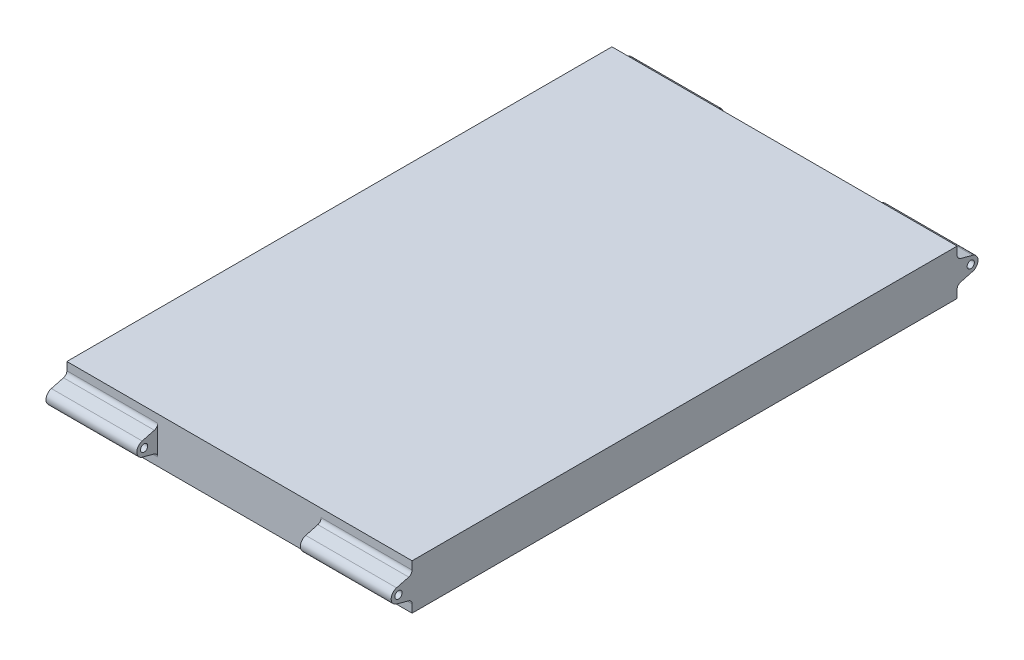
ISO-10303-21;
HEADER;
FILE_DESCRIPTION(('STEP AP214'),'2;1');
FILE_NAME('part.step','',(''),(''),'','','');
FILE_SCHEMA(('AUTOMOTIVE_DESIGN { 1 0 10303 214 1 1 1 1 }'));
ENDSEC;
DATA;
#1=APPLICATION_CONTEXT('core data for automotive mechanical design processes');
#2=APPLICATION_PROTOCOL_DEFINITION('international standard','automotive_design',2000,#1);
#3=PRODUCT_CONTEXT('',#1,'mechanical');
#4=PRODUCT('Part','Part','',(#3));
#5=PRODUCT_RELATED_PRODUCT_CATEGORY('part','',(#4));
#6=PRODUCT_DEFINITION_FORMATION('','',#4);
#7=PRODUCT_DEFINITION_CONTEXT('part definition',#1,'design');
#8=PRODUCT_DEFINITION('design','',#6,#7);
#9=PRODUCT_DEFINITION_SHAPE('','',#8);
#10=(LENGTH_UNIT() NAMED_UNIT(*) SI_UNIT(.MILLI.,.METRE.));
#11=(NAMED_UNIT(*) PLANE_ANGLE_UNIT() SI_UNIT($,.RADIAN.));
#12=(NAMED_UNIT(*) SI_UNIT($,.STERADIAN.) SOLID_ANGLE_UNIT());
#13=UNCERTAINTY_MEASURE_WITH_UNIT(LENGTH_MEASURE(1.E-05),#10,'distance_accuracy_value','');
#14=(GEOMETRIC_REPRESENTATION_CONTEXT(3) GLOBAL_UNCERTAINTY_ASSIGNED_CONTEXT((#13)) GLOBAL_UNIT_ASSIGNED_CONTEXT((#10,
#11,#12)) REPRESENTATION_CONTEXT('',''));
#15=CARTESIAN_POINT('',(0.,0.,0.));
#16=DIRECTION('',(0.,0.,1.));
#17=DIRECTION('',(1.,0.,0.));
#18=AXIS2_PLACEMENT_3D('',#15,#16,#17);
#19=CARTESIAN_POINT('',(-190.,10.,300.));
#20=DIRECTION('',(0.,0.,-1.));
#21=DIRECTION('',(-1.,0.,0.));
#22=AXIS2_PLACEMENT_3D('',#19,#20,#21);
#23=PLANE('',#22);
#24=DIRECTION('',(0.,-1.,0.));
#25=VECTOR('',#24,1.);
#26=CARTESIAN_POINT('',(-190.,10.,300.));
#27=LINE('',#26,#25);
#28=CARTESIAN_POINT('',(-190.,10.,300.));
#29=VERTEX_POINT('',#28);
#30=CARTESIAN_POINT('',(-190.,1.13808226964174,300.));
#31=VERTEX_POINT('',#30);
#32=EDGE_CURVE('E450',#29,#31,#27,.T.);
#33=ORIENTED_EDGE('',*,*,#32,.T.);
#34=DIRECTION('',(-1.,0.,0.));
#35=VECTOR('',#34,1.);
#36=CARTESIAN_POINT('',(-89.9999999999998,1.13808226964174,300.));
#37=LINE('',#36,#35);
#38=CARTESIAN_POINT('',(-89.9999999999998,1.13808226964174,300.));
#39=VERTEX_POINT('',#38);
#40=EDGE_CURVE('E469',#31,#39,#37,.F.);
#41=ORIENTED_EDGE('',*,*,#40,.T.);
#42=DIRECTION('',(0.,1.,0.));
#43=VECTOR('',#42,1.);
#44=CARTESIAN_POINT('',(-89.9999999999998,-27.301447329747,300.));
#45=LINE('',#44,#43);
#46=CARTESIAN_POINT('',(-89.9999999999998,-31.1380822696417,300.));
#47=VERTEX_POINT('',#46);
#48=EDGE_CURVE('E322',#47,#39,#45,.T.);
#49=ORIENTED_EDGE('',*,*,#48,.F.);
#50=DIRECTION('',(-1.,0.,0.));
#51=VECTOR('',#50,1.);
#52=CARTESIAN_POINT('',(-190.,-31.1380822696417,300.));
#53=LINE('',#52,#51);
#54=CARTESIAN_POINT('',(-190.,-31.1380822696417,300.));
#55=VERTEX_POINT('',#54);
#56=EDGE_CURVE('E572',#47,#55,#53,.T.);
#57=ORIENTED_EDGE('',*,*,#56,.T.);
#58=CARTESIAN_POINT('',(-190.,-40.,300.));
#59=VERTEX_POINT('',#58);
#60=EDGE_CURVE('E461',#55,#59,#27,.T.);
#61=ORIENTED_EDGE('',*,*,#60,.T.);
#62=DIRECTION('',(1.,0.,0.));
#63=VECTOR('',#62,1.);
#64=CARTESIAN_POINT('',(-190.,-40.,300.));
#65=LINE('',#64,#63);
#66=CARTESIAN_POINT('',(190.,-40.,300.));
#67=VERTEX_POINT('',#66);
#68=EDGE_CURVE('E435',#59,#67,#65,.T.);
#69=ORIENTED_EDGE('',*,*,#68,.T.);
#70=DIRECTION('',(0.,-1.,0.));
#71=VECTOR('',#70,1.);
#72=CARTESIAN_POINT('',(190.,10.,300.));
#73=LINE('',#72,#71);
#74=CARTESIAN_POINT('',(190.,-31.1380822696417,300.));
#75=VERTEX_POINT('',#74);
#76=EDGE_CURVE('E447',#75,#67,#73,.T.);
#77=ORIENTED_EDGE('',*,*,#76,.F.);
#78=DIRECTION('',(1.,0.,0.));
#79=VECTOR('',#78,1.);
#80=CARTESIAN_POINT('',(-190.,-31.1380822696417,300.));
#81=LINE('',#80,#79);
#82=CARTESIAN_POINT('',(89.9999999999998,-31.1380822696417,300.));
#83=VERTEX_POINT('',#82);
#84=EDGE_CURVE('E524',#75,#83,#81,.F.);
#85=ORIENTED_EDGE('',*,*,#84,.T.);
#86=DIRECTION('',(0.,1.,0.));
#87=VECTOR('',#86,1.);
#88=CARTESIAN_POINT('',(89.9999999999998,-27.301447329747,300.));
#89=LINE('',#88,#87);
#90=CARTESIAN_POINT('',(89.9999999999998,1.13808226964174,300.));
#91=VERTEX_POINT('',#90);
#92=EDGE_CURVE('E378',#83,#91,#89,.T.);
#93=ORIENTED_EDGE('',*,*,#92,.T.);
#94=DIRECTION('',(1.,0.,0.));
#95=VECTOR('',#94,1.);
#96=CARTESIAN_POINT('',(-190.,1.13808226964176,300.));
#97=LINE('',#96,#95);
#98=CARTESIAN_POINT('',(190.,1.13808226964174,300.));
#99=VERTEX_POINT('',#98);
#100=EDGE_CURVE('E578',#91,#99,#97,.T.);
#101=ORIENTED_EDGE('',*,*,#100,.T.);
#102=CARTESIAN_POINT('',(190.,10.,300.));
#103=VERTEX_POINT('',#102);
#104=EDGE_CURVE('E457',#103,#99,#73,.T.);
#105=ORIENTED_EDGE('',*,*,#104,.F.);
#106=DIRECTION('',(1.,0.,0.));
#107=VECTOR('',#106,1.);
#108=CARTESIAN_POINT('',(-190.,10.,300.));
#109=LINE('',#108,#107);
#110=EDGE_CURVE('E445',#29,#103,#109,.T.);
#111=ORIENTED_EDGE('',*,*,#110,.F.);
#112=EDGE_LOOP('',(#33,#41,#49,#57,#61,#69,#77,#85,#93,#101,#105,#111));
#113=FACE_BOUND('',#112,.T.);
#114=ADVANCED_FACE('F60',(#113),#23,.F.);
#115=CARTESIAN_POINT('',(-190.,10.,-300.));
#116=DIRECTION('',(0.,0.,1.));
#117=DIRECTION('',(1.,0.,0.));
#118=AXIS2_PLACEMENT_3D('',#115,#116,#117);
#119=PLANE('',#118);
#120=DIRECTION('',(0.,1.,0.));
#121=VECTOR('',#120,1.);
#122=CARTESIAN_POINT('',(-89.9999999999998,-27.301447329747,-300.));
#123=LINE('',#122,#121);
#124=CARTESIAN_POINT('',(-89.9999999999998,-31.1380822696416,-300.));
#125=VERTEX_POINT('',#124);
#126=CARTESIAN_POINT('',(-89.9999999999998,1.13808226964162,-300.));
#127=VERTEX_POINT('',#126);
#128=EDGE_CURVE('E290',#125,#127,#123,.T.);
#129=ORIENTED_EDGE('',*,*,#128,.T.);
#130=DIRECTION('',(-1.,0.,0.));
#131=VECTOR('',#130,1.);
#132=CARTESIAN_POINT('',(-190.,1.13808226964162,-300.));
#133=LINE('',#132,#131);
#134=CARTESIAN_POINT('',(-190.,1.13808226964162,-300.));
#135=VERTEX_POINT('',#134);
#136=EDGE_CURVE('E562',#127,#135,#133,.T.);
#137=ORIENTED_EDGE('',*,*,#136,.T.);
#138=DIRECTION('',(0.,-1.,0.));
#139=VECTOR('',#138,1.);
#140=CARTESIAN_POINT('',(-190.,10.,-300.));
#141=LINE('',#140,#139);
#142=CARTESIAN_POINT('',(-190.,10.,-300.));
#143=VERTEX_POINT('',#142);
#144=EDGE_CURVE('E544',#143,#135,#141,.T.);
#145=ORIENTED_EDGE('',*,*,#144,.F.);
#146=DIRECTION('',(-1.,0.,0.));
#147=VECTOR('',#146,1.);
#148=CARTESIAN_POINT('',(-190.,10.,-300.));
#149=LINE('',#148,#147);
#150=CARTESIAN_POINT('',(190.,10.,-300.));
#151=VERTEX_POINT('',#150);
#152=EDGE_CURVE('E441',#151,#143,#149,.T.);
#153=ORIENTED_EDGE('',*,*,#152,.F.);
#154=DIRECTION('',(0.,-1.,0.));
#155=VECTOR('',#154,1.);
#156=CARTESIAN_POINT('',(190.,10.,-300.));
#157=LINE('',#156,#155);
#158=CARTESIAN_POINT('',(190.,1.13808226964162,-300.));
#159=VERTEX_POINT('',#158);
#160=EDGE_CURVE('E543',#151,#159,#157,.T.);
#161=ORIENTED_EDGE('',*,*,#160,.T.);
#162=DIRECTION('',(1.,0.,0.));
#163=VECTOR('',#162,1.);
#164=CARTESIAN_POINT('',(89.9999999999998,1.13808226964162,-300.));
#165=LINE('',#164,#163);
#166=CARTESIAN_POINT('',(89.9999999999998,1.13808226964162,-300.));
#167=VERTEX_POINT('',#166);
#168=EDGE_CURVE('E559',#159,#167,#165,.F.);
#169=ORIENTED_EDGE('',*,*,#168,.T.);
#170=DIRECTION('',(0.,1.,0.));
#171=VECTOR('',#170,1.);
#172=CARTESIAN_POINT('',(89.9999999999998,-27.301447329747,-300.));
#173=LINE('',#172,#171);
#174=CARTESIAN_POINT('',(89.9999999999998,-31.1380822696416,-300.));
#175=VERTEX_POINT('',#174);
#176=EDGE_CURVE('E350',#175,#167,#173,.T.);
#177=ORIENTED_EDGE('',*,*,#176,.F.);
#178=DIRECTION('',(1.,0.,0.));
#179=VECTOR('',#178,1.);
#180=CARTESIAN_POINT('',(190.,-31.1380822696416,-300.));
#181=LINE('',#180,#179);
#182=CARTESIAN_POINT('',(190.,-31.1380822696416,-300.));
#183=VERTEX_POINT('',#182);
#184=EDGE_CURVE('E557',#175,#183,#181,.T.);
#185=ORIENTED_EDGE('',*,*,#184,.T.);
#186=CARTESIAN_POINT('',(190.,-40.,-300.));
#187=VERTEX_POINT('',#186);
#188=EDGE_CURVE('E539',#183,#187,#157,.T.);
#189=ORIENTED_EDGE('',*,*,#188,.T.);
#190=DIRECTION('',(-1.,0.,0.));
#191=VECTOR('',#190,1.);
#192=CARTESIAN_POINT('',(-190.,-40.,-300.));
#193=LINE('',#192,#191);
#194=CARTESIAN_POINT('',(-190.,-40.,-300.));
#195=VERTEX_POINT('',#194);
#196=EDGE_CURVE('E429',#187,#195,#193,.T.);
#197=ORIENTED_EDGE('',*,*,#196,.T.);
#198=CARTESIAN_POINT('',(-190.,-31.1380822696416,-300.));
#199=VERTEX_POINT('',#198);
#200=EDGE_CURVE('E550',#199,#195,#141,.T.);
#201=ORIENTED_EDGE('',*,*,#200,.F.);
#202=DIRECTION('',(-1.,0.,0.));
#203=VECTOR('',#202,1.);
#204=CARTESIAN_POINT('',(-190.,-31.1380822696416,-300.));
#205=LINE('',#204,#203);
#206=EDGE_CURVE('E547',#199,#125,#205,.F.);
#207=ORIENTED_EDGE('',*,*,#206,.T.);
#208=EDGE_LOOP('',(#129,#137,#145,#153,#161,#169,#177,#185,#189,#197,#201,#207));
#209=FACE_BOUND('',#208,.T.);
#210=ADVANCED_FACE('F608',(#209),#119,.F.);
#211=CARTESIAN_POINT('',(190.,10.,-300.));
#212=DIRECTION('',(-1.,0.,0.));
#213=DIRECTION('',(0.,0.,1.));
#214=AXIS2_PLACEMENT_3D('',#211,#212,#213);
#215=PLANE('',#214);
#216=ORIENTED_EDGE('',*,*,#104,.T.);
#217=CARTESIAN_POINT('',(190.,1.13808226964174,305.));
#218=DIRECTION('',(-1.,0.,0.));
#219=DIRECTION('',(0.,0.,1.));
#220=AXIS2_PLACEMENT_3D('',#217,#218,#219);
#221=CIRCLE('',#220,5.);
#222=CARTESIAN_POINT('',(190.,-3.6915468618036,303.705904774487));
#223=VERTEX_POINT('',#222);
#224=EDGE_CURVE('E494',#99,#223,#221,.T.);
#225=ORIENTED_EDGE('',*,*,#224,.T.);
#226=DIRECTION('',(0.,-0.258819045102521,0.965925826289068));
#227=VECTOR('',#226,1.);
#228=CARTESIAN_POINT('',(190.,-7.27259338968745,317.070552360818));
#229=LINE('',#228,#227);
#230=CARTESIAN_POINT('',(190.,-7.27259338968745,317.070552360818));
#231=VERTEX_POINT('',#230);
#232=EDGE_CURVE('E375',#223,#231,#229,.T.);
#233=ORIENTED_EDGE('',*,*,#232,.T.);
#234=CARTESIAN_POINT('',(190.,-15.,314.999999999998));
#235=DIRECTION('',(1.,0.,0.));
#236=DIRECTION('',(0.,0.,-1.));
#237=AXIS2_PLACEMENT_3D('',#234,#235,#236);
#238=CIRCLE('',#237,8.);
#239=CARTESIAN_POINT('',(190.,-22.7274066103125,317.070552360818));
#240=VERTEX_POINT('',#239);
#241=EDGE_CURVE('E368',#231,#240,#238,.T.);
#242=ORIENTED_EDGE('',*,*,#241,.T.);
#243=DIRECTION('',(0.,-0.258819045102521,-0.965925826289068));
#244=VECTOR('',#243,1.);
#245=CARTESIAN_POINT('',(190.,-22.7274066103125,317.070552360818));
#246=LINE('',#245,#244);
#247=CARTESIAN_POINT('',(190.,-26.3084531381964,303.705904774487));
#248=VERTEX_POINT('',#247);
#249=EDGE_CURVE('E385',#240,#248,#246,.T.);
#250=ORIENTED_EDGE('',*,*,#249,.T.);
#251=CARTESIAN_POINT('',(190.,-31.1380822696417,305.));
#252=DIRECTION('',(-1.,0.,0.));
#253=DIRECTION('',(0.,0.,1.));
#254=AXIS2_PLACEMENT_3D('',#251,#252,#253);
#255=CIRCLE('',#254,5.);
#256=EDGE_CURVE('E507',#248,#75,#255,.T.);
#257=ORIENTED_EDGE('',*,*,#256,.T.);
#258=ORIENTED_EDGE('',*,*,#76,.T.);
#259=DIRECTION('',(0.,0.,-1.));
#260=VECTOR('',#259,1.);
#261=CARTESIAN_POINT('',(190.,-40.,-300.));
#262=LINE('',#261,#260);
#263=EDGE_CURVE('E418',#67,#187,#262,.T.);
#264=ORIENTED_EDGE('',*,*,#263,.T.);
#265=ORIENTED_EDGE('',*,*,#188,.F.);
#266=CARTESIAN_POINT('',(190.,-31.1380822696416,-305.));
#267=DIRECTION('',(-1.,0.,0.));
#268=DIRECTION('',(0.,0.,1.));
#269=AXIS2_PLACEMENT_3D('',#266,#267,#268);
#270=CIRCLE('',#269,5.);
#271=CARTESIAN_POINT('',(190.,-26.3084531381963,-303.705904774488));
#272=VERTEX_POINT('',#271);
#273=EDGE_CURVE('E499',#183,#272,#270,.T.);
#274=ORIENTED_EDGE('',*,*,#273,.T.);
#275=DIRECTION('',(0.,-0.258819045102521,0.965925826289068));
#276=VECTOR('',#275,1.);
#277=CARTESIAN_POINT('',(190.,-22.7274066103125,-317.070552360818));
#278=LINE('',#277,#276);
#279=CARTESIAN_POINT('',(190.,-22.7274066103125,-317.070552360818));
#280=VERTEX_POINT('',#279);
#281=EDGE_CURVE('E348',#280,#272,#278,.T.);
#282=ORIENTED_EDGE('',*,*,#281,.F.);
#283=CARTESIAN_POINT('',(190.,-15.,-314.999999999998));
#284=DIRECTION('',(-1.,0.,0.));
#285=DIRECTION('',(0.,0.,1.));
#286=AXIS2_PLACEMENT_3D('',#283,#284,#285);
#287=CIRCLE('',#286,8.);
#288=CARTESIAN_POINT('',(190.,-7.27259338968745,-317.070552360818));
#289=VERTEX_POINT('',#288);
#290=EDGE_CURVE('E341',#289,#280,#287,.T.);
#291=ORIENTED_EDGE('',*,*,#290,.F.);
#292=DIRECTION('',(0.,-0.258819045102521,-0.965925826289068));
#293=VECTOR('',#292,1.);
#294=CARTESIAN_POINT('',(190.,-7.27259338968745,-317.070552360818));
#295=LINE('',#294,#293);
#296=CARTESIAN_POINT('',(190.,-3.69154686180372,-303.705904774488));
#297=VERTEX_POINT('',#296);
#298=EDGE_CURVE('E358',#297,#289,#295,.T.);
#299=ORIENTED_EDGE('',*,*,#298,.F.);
#300=CARTESIAN_POINT('',(190.,1.13808226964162,-305.));
#301=DIRECTION('',(-1.,0.,0.));
#302=DIRECTION('',(0.,0.,1.));
#303=AXIS2_PLACEMENT_3D('',#300,#301,#302);
#304=CIRCLE('',#303,5.);
#305=EDGE_CURVE('E486',#297,#159,#304,.T.);
#306=ORIENTED_EDGE('',*,*,#305,.T.);
#307=ORIENTED_EDGE('',*,*,#160,.F.);
#308=DIRECTION('',(0.,0.,-1.));
#309=VECTOR('',#308,1.);
#310=CARTESIAN_POINT('',(190.,10.,-300.));
#311=LINE('',#310,#309);
#312=EDGE_CURVE('E438',#103,#151,#311,.T.);
#313=ORIENTED_EDGE('',*,*,#312,.F.);
#314=EDGE_LOOP('',(#216,#225,#233,#242,#250,#257,#258,#264,#265,#274,#282,#291,#299,#306,#307,#313));
#315=FACE_BOUND('',#314,.T.);
#316=CARTESIAN_POINT('',(190.,-15.,314.999999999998));
#317=DIRECTION('',(1.,0.,0.));
#318=DIRECTION('',(0.,0.,1.));
#319=AXIS2_PLACEMENT_3D('',#316,#317,#318);
#320=CIRCLE('',#319,3.99999999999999);
#321=CARTESIAN_POINT('',(190.,-15.,318.999999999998));
#322=VERTEX_POINT('',#321);
#323=EDGE_CURVE('E362',#322,#322,#320,.T.);
#324=ORIENTED_EDGE('',*,*,#323,.F.);
#325=EDGE_LOOP('',(#324));
#326=FACE_BOUND('',#325,.T.);
#327=CARTESIAN_POINT('',(190.,-15.,-314.999999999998));
#328=DIRECTION('',(-1.,0.,0.));
#329=DIRECTION('',(0.,0.,-1.));
#330=AXIS2_PLACEMENT_3D('',#327,#328,#329);
#331=CIRCLE('',#330,3.99999999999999);
#332=CARTESIAN_POINT('',(190.,-15.,-318.999999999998));
#333=VERTEX_POINT('',#332);
#334=EDGE_CURVE('E335',#333,#333,#331,.T.);
#335=ORIENTED_EDGE('',*,*,#334,.T.);
#336=EDGE_LOOP('',(#335));
#337=FACE_BOUND('',#336,.T.);
#338=ADVANCED_FACE('F527',(#315,#326,#337),#215,.F.);
#339=CARTESIAN_POINT('',(-190.,10.,-300.));
#340=DIRECTION('',(1.,0.,0.));
#341=DIRECTION('',(0.,0.,-1.));
#342=AXIS2_PLACEMENT_3D('',#339,#340,#341);
#343=PLANE('',#342);
#344=ORIENTED_EDGE('',*,*,#144,.T.);
#345=CARTESIAN_POINT('',(-190.,1.13808226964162,-305.));
#346=DIRECTION('',(1.,0.,0.));
#347=DIRECTION('',(0.,0.,-1.));
#348=AXIS2_PLACEMENT_3D('',#345,#346,#347);
#349=CIRCLE('',#348,5.);
#350=CARTESIAN_POINT('',(-190.,-3.69154686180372,-303.705904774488));
#351=VERTEX_POINT('',#350);
#352=EDGE_CURVE('E481',#135,#351,#349,.T.);
#353=ORIENTED_EDGE('',*,*,#352,.T.);
#354=DIRECTION('',(0.,-0.258819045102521,-0.965925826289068));
#355=VECTOR('',#354,1.);
#356=CARTESIAN_POINT('',(-190.,-7.27259338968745,-317.070552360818));
#357=LINE('',#356,#355);
#358=CARTESIAN_POINT('',(-190.,-7.27259338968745,-317.070552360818));
#359=VERTEX_POINT('',#358);
#360=EDGE_CURVE('E295',#351,#359,#357,.T.);
#361=ORIENTED_EDGE('',*,*,#360,.T.);
#362=CARTESIAN_POINT('',(-190.,-15.,-314.999999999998));
#363=DIRECTION('',(-1.,0.,0.));
#364=DIRECTION('',(0.,0.,1.));
#365=AXIS2_PLACEMENT_3D('',#362,#363,#364);
#366=CIRCLE('',#365,8.);
#367=CARTESIAN_POINT('',(-190.,-22.7274066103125,-317.070552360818));
#368=VERTEX_POINT('',#367);
#369=EDGE_CURVE('E304',#359,#368,#366,.T.);
#370=ORIENTED_EDGE('',*,*,#369,.T.);
#371=DIRECTION('',(0.,-0.258819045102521,0.965925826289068));
#372=VECTOR('',#371,1.);
#373=CARTESIAN_POINT('',(-190.,-22.7274066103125,-317.070552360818));
#374=LINE('',#373,#372);
#375=CARTESIAN_POINT('',(-190.,-26.3084531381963,-303.705904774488));
#376=VERTEX_POINT('',#375);
#377=EDGE_CURVE('E275',#368,#376,#374,.T.);
#378=ORIENTED_EDGE('',*,*,#377,.T.);
#379=CARTESIAN_POINT('',(-190.,-31.1380822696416,-305.));
#380=DIRECTION('',(1.,0.,0.));
#381=DIRECTION('',(0.,0.,-1.));
#382=AXIS2_PLACEMENT_3D('',#379,#380,#381);
#383=CIRCLE('',#382,5.);
#384=EDGE_CURVE('E504',#376,#199,#383,.T.);
#385=ORIENTED_EDGE('',*,*,#384,.T.);
#386=ORIENTED_EDGE('',*,*,#200,.T.);
#387=DIRECTION('',(0.,0.,1.));
#388=VECTOR('',#387,1.);
#389=CARTESIAN_POINT('',(-190.,-40.,-300.));
#390=LINE('',#389,#388);
#391=EDGE_CURVE('E432',#195,#59,#390,.T.);
#392=ORIENTED_EDGE('',*,*,#391,.T.);
#393=ORIENTED_EDGE('',*,*,#60,.F.);
#394=CARTESIAN_POINT('',(-190.,-31.1380822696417,305.));
#395=DIRECTION('',(1.,0.,0.));
#396=DIRECTION('',(0.,0.,-1.));
#397=AXIS2_PLACEMENT_3D('',#394,#395,#396);
#398=CIRCLE('',#397,5.);
#399=CARTESIAN_POINT('',(-190.,-26.3084531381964,303.705904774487));
#400=VERTEX_POINT('',#399);
#401=EDGE_CURVE('E68',#55,#400,#398,.T.);
#402=ORIENTED_EDGE('',*,*,#401,.T.);
#403=DIRECTION('',(0.,-0.258819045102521,-0.965925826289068));
#404=VECTOR('',#403,1.);
#405=CARTESIAN_POINT('',(-190.,-22.7274066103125,317.070552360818));
#406=LINE('',#405,#404);
#407=CARTESIAN_POINT('',(-190.,-22.7274066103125,317.070552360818));
#408=VERTEX_POINT('',#407);
#409=EDGE_CURVE('E320',#408,#400,#406,.T.);
#410=ORIENTED_EDGE('',*,*,#409,.F.);
#411=CARTESIAN_POINT('',(-190.,-15.,314.999999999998));
#412=DIRECTION('',(1.,0.,0.));
#413=DIRECTION('',(0.,0.,-1.));
#414=AXIS2_PLACEMENT_3D('',#411,#412,#413);
#415=CIRCLE('',#414,8.);
#416=CARTESIAN_POINT('',(-190.,-7.27259338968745,317.070552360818));
#417=VERTEX_POINT('',#416);
#418=EDGE_CURVE('E313',#417,#408,#415,.T.);
#419=ORIENTED_EDGE('',*,*,#418,.F.);
#420=DIRECTION('',(0.,-0.258819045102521,0.965925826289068));
#421=VECTOR('',#420,1.);
#422=CARTESIAN_POINT('',(-190.,-7.27259338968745,317.070552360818));
#423=LINE('',#422,#421);
#424=CARTESIAN_POINT('',(-190.,-3.6915468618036,303.705904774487));
#425=VERTEX_POINT('',#424);
#426=EDGE_CURVE('E329',#425,#417,#423,.T.);
#427=ORIENTED_EDGE('',*,*,#426,.F.);
#428=CARTESIAN_POINT('',(-190.,1.13808226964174,305.));
#429=DIRECTION('',(1.,0.,0.));
#430=DIRECTION('',(0.,0.,-1.));
#431=AXIS2_PLACEMENT_3D('',#428,#429,#430);
#432=CIRCLE('',#431,5.);
#433=EDGE_CURVE('E490',#425,#31,#432,.T.);
#434=ORIENTED_EDGE('',*,*,#433,.T.);
#435=ORIENTED_EDGE('',*,*,#32,.F.);
#436=DIRECTION('',(0.,0.,1.));
#437=VECTOR('',#436,1.);
#438=CARTESIAN_POINT('',(-190.,10.,-300.));
#439=LINE('',#438,#437);
#440=EDGE_CURVE('E443',#143,#29,#439,.T.);
#441=ORIENTED_EDGE('',*,*,#440,.F.);
#442=EDGE_LOOP('',(#344,#353,#361,#370,#378,#385,#386,#392,#393,#402,#410,#419,#427,#434,#435,#441));
#443=FACE_BOUND('',#442,.T.);
#444=CARTESIAN_POINT('',(-190.,-15.,314.999999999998));
#445=DIRECTION('',(1.,0.,0.));
#446=DIRECTION('',(0.,0.,1.));
#447=AXIS2_PLACEMENT_3D('',#444,#445,#446);
#448=CIRCLE('',#447,3.99999999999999);
#449=CARTESIAN_POINT('',(-190.,-15.,318.999999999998));
#450=VERTEX_POINT('',#449);
#451=EDGE_CURVE('E308',#450,#450,#448,.T.);
#452=ORIENTED_EDGE('',*,*,#451,.T.);
#453=EDGE_LOOP('',(#452));
#454=FACE_BOUND('',#453,.T.);
#455=CARTESIAN_POINT('',(-190.,-15.,-314.999999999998));
#456=DIRECTION('',(-1.,0.,0.));
#457=DIRECTION('',(0.,0.,-1.));
#458=AXIS2_PLACEMENT_3D('',#455,#456,#457);
#459=CIRCLE('',#458,3.99999999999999);
#460=CARTESIAN_POINT('',(-190.,-15.,-318.999999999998));
#461=VERTEX_POINT('',#460);
#462=EDGE_CURVE('E299',#461,#461,#459,.T.);
#463=ORIENTED_EDGE('',*,*,#462,.F.);
#464=EDGE_LOOP('',(#463));
#465=FACE_BOUND('',#464,.T.);
#466=ADVANCED_FACE('F618',(#443,#454,#465),#343,.F.);
#467=CARTESIAN_POINT('',(190.,10.,300.));
#468=DIRECTION('',(0.,1.,0.));
#469=DIRECTION('',(0.,0.,1.));
#470=AXIS2_PLACEMENT_3D('',#467,#468,#469);
#471=PLANE('',#470);
#472=ORIENTED_EDGE('',*,*,#312,.T.);
#473=ORIENTED_EDGE('',*,*,#152,.T.);
#474=ORIENTED_EDGE('',*,*,#440,.T.);
#475=ORIENTED_EDGE('',*,*,#110,.T.);
#476=EDGE_LOOP('',(#472,#473,#474,#475));
#477=FACE_BOUND('',#476,.T.);
#478=ADVANCED_FACE('F620',(#477),#471,.T.);
#479=CARTESIAN_POINT('',(190.,-40.,-300.));
#480=DIRECTION('',(0.,1.,0.));
#481=DIRECTION('',(0.,0.,1.));
#482=AXIS2_PLACEMENT_3D('',#479,#480,#481);
#483=PLANE('',#482);
#484=DIRECTION('',(1.,0.,0.));
#485=VECTOR('',#484,1.);
#486=CARTESIAN_POINT('',(-190.,-40.,290.));
#487=LINE('',#486,#485);
#488=CARTESIAN_POINT('',(-180.,-40.,290.));
#489=VERTEX_POINT('',#488);
#490=CARTESIAN_POINT('',(180.,-40.,290.));
#491=VERTEX_POINT('',#490);
#492=EDGE_CURVE('E401',#489,#491,#487,.T.);
#493=ORIENTED_EDGE('',*,*,#492,.T.);
#494=DIRECTION('',(0.,0.,-1.));
#495=VECTOR('',#494,1.);
#496=CARTESIAN_POINT('',(180.,-40.,-300.));
#497=LINE('',#496,#495);
#498=CARTESIAN_POINT('',(180.,-40.,-290.));
#499=VERTEX_POINT('',#498);
#500=EDGE_CURVE('E391',#491,#499,#497,.T.);
#501=ORIENTED_EDGE('',*,*,#500,.T.);
#502=DIRECTION('',(-1.,0.,0.));
#503=VECTOR('',#502,1.);
#504=CARTESIAN_POINT('',(-190.,-40.,-290.));
#505=LINE('',#504,#503);
#506=CARTESIAN_POINT('',(-180.,-40.,-290.));
#507=VERTEX_POINT('',#506);
#508=EDGE_CURVE('E394',#499,#507,#505,.T.);
#509=ORIENTED_EDGE('',*,*,#508,.T.);
#510=DIRECTION('',(0.,0.,1.));
#511=VECTOR('',#510,1.);
#512=CARTESIAN_POINT('',(-180.,-40.,-300.));
#513=LINE('',#512,#511);
#514=EDGE_CURVE('E398',#507,#489,#513,.T.);
#515=ORIENTED_EDGE('',*,*,#514,.T.);
#516=EDGE_LOOP('',(#493,#501,#509,#515));
#517=FACE_BOUND('',#516,.T.);
#518=ORIENTED_EDGE('',*,*,#263,.F.);
#519=ORIENTED_EDGE('',*,*,#68,.F.);
#520=ORIENTED_EDGE('',*,*,#391,.F.);
#521=ORIENTED_EDGE('',*,*,#196,.F.);
#522=EDGE_LOOP('',(#518,#519,#520,#521));
#523=FACE_BOUND('',#522,.T.);
#524=ADVANCED_FACE('F536',(#517,#523),#483,.F.);
#525=CARTESIAN_POINT('',(180.,-40.,-300.));
#526=DIRECTION('',(1.,0.,0.));
#527=DIRECTION('',(0.,0.,-1.));
#528=AXIS2_PLACEMENT_3D('',#525,#526,#527);
#529=PLANE('',#528);
#530=DIRECTION('',(0.,0.,-1.));
#531=VECTOR('',#530,1.);
#532=CARTESIAN_POINT('',(180.,0.,-300.));
#533=LINE('',#532,#531);
#534=CARTESIAN_POINT('',(180.,0.,290.));
#535=VERTEX_POINT('',#534);
#536=CARTESIAN_POINT('',(180.,0.,-290.));
#537=VERTEX_POINT('',#536);
#538=EDGE_CURVE('E389',#535,#537,#533,.T.);
#539=ORIENTED_EDGE('',*,*,#538,.T.);
#540=DIRECTION('',(0.,1.,0.));
#541=VECTOR('',#540,1.);
#542=CARTESIAN_POINT('',(180.,-40.,-290.));
#543=LINE('',#542,#541);
#544=EDGE_CURVE('E404',#499,#537,#543,.T.);
#545=ORIENTED_EDGE('',*,*,#544,.F.);
#546=ORIENTED_EDGE('',*,*,#500,.F.);
#547=DIRECTION('',(0.,1.,0.));
#548=VECTOR('',#547,1.);
#549=CARTESIAN_POINT('',(180.,-40.,290.));
#550=LINE('',#549,#548);
#551=EDGE_CURVE('E415',#491,#535,#550,.T.);
#552=ORIENTED_EDGE('',*,*,#551,.T.);
#553=EDGE_LOOP('',(#539,#545,#546,#552));
#554=FACE_BOUND('',#553,.T.);
#555=ADVANCED_FACE('F718',(#554),#529,.F.);
#556=CARTESIAN_POINT('',(-190.,-40.,290.));
#557=DIRECTION('',(0.,0.,1.));
#558=DIRECTION('',(1.,0.,0.));
#559=AXIS2_PLACEMENT_3D('',#556,#557,#558);
#560=PLANE('',#559);
#561=DIRECTION('',(1.,0.,0.));
#562=VECTOR('',#561,1.);
#563=CARTESIAN_POINT('',(-190.,0.,290.));
#564=LINE('',#563,#562);
#565=CARTESIAN_POINT('',(-180.,0.,290.));
#566=VERTEX_POINT('',#565);
#567=EDGE_CURVE('E395',#566,#535,#564,.T.);
#568=ORIENTED_EDGE('',*,*,#567,.T.);
#569=ORIENTED_EDGE('',*,*,#551,.F.);
#570=ORIENTED_EDGE('',*,*,#492,.F.);
#571=DIRECTION('',(0.,1.,0.));
#572=VECTOR('',#571,1.);
#573=CARTESIAN_POINT('',(-180.,-40.,290.));
#574=LINE('',#573,#572);
#575=EDGE_CURVE('E419',#489,#566,#574,.T.);
#576=ORIENTED_EDGE('',*,*,#575,.T.);
#577=EDGE_LOOP('',(#568,#569,#570,#576));
#578=FACE_BOUND('',#577,.T.);
#579=ADVANCED_FACE('F714',(#578),#560,.F.);
#580=CARTESIAN_POINT('',(-180.,-40.,-300.));
#581=DIRECTION('',(-1.,0.,0.));
#582=DIRECTION('',(0.,0.,1.));
#583=AXIS2_PLACEMENT_3D('',#580,#581,#582);
#584=PLANE('',#583);
#585=DIRECTION('',(0.,0.,1.));
#586=VECTOR('',#585,1.);
#587=CARTESIAN_POINT('',(-180.,0.,-300.));
#588=LINE('',#587,#586);
#589=CARTESIAN_POINT('',(-180.,0.,-290.));
#590=VERTEX_POINT('',#589);
#591=EDGE_CURVE('E410',#590,#566,#588,.T.);
#592=ORIENTED_EDGE('',*,*,#591,.T.);
#593=ORIENTED_EDGE('',*,*,#575,.F.);
#594=ORIENTED_EDGE('',*,*,#514,.F.);
#595=DIRECTION('',(0.,1.,0.));
#596=VECTOR('',#595,1.);
#597=CARTESIAN_POINT('',(-180.,-40.,-290.));
#598=LINE('',#597,#596);
#599=EDGE_CURVE('E422',#507,#590,#598,.T.);
#600=ORIENTED_EDGE('',*,*,#599,.T.);
#601=EDGE_LOOP('',(#592,#593,#594,#600));
#602=FACE_BOUND('',#601,.T.);
#603=ADVANCED_FACE('F717',(#602),#584,.F.);
#604=CARTESIAN_POINT('',(-190.,-40.,-290.));
#605=DIRECTION('',(0.,0.,-1.));
#606=DIRECTION('',(-1.,0.,0.));
#607=AXIS2_PLACEMENT_3D('',#604,#605,#606);
#608=PLANE('',#607);
#609=DIRECTION('',(-1.,0.,0.));
#610=VECTOR('',#609,1.);
#611=CARTESIAN_POINT('',(-190.,0.,-290.));
#612=LINE('',#611,#610);
#613=EDGE_CURVE('E407',#537,#590,#612,.T.);
#614=ORIENTED_EDGE('',*,*,#613,.T.);
#615=ORIENTED_EDGE('',*,*,#599,.F.);
#616=ORIENTED_EDGE('',*,*,#508,.F.);
#617=ORIENTED_EDGE('',*,*,#544,.T.);
#618=EDGE_LOOP('',(#614,#615,#616,#617));
#619=FACE_BOUND('',#618,.T.);
#620=ADVANCED_FACE('F722',(#619),#608,.F.);
#621=CARTESIAN_POINT('',(190.,0.,300.));
#622=DIRECTION('',(0.,1.,0.));
#623=DIRECTION('',(0.,0.,1.));
#624=AXIS2_PLACEMENT_3D('',#621,#622,#623);
#625=PLANE('',#624);
#626=ORIENTED_EDGE('',*,*,#538,.F.);
#627=ORIENTED_EDGE('',*,*,#567,.F.);
#628=ORIENTED_EDGE('',*,*,#591,.F.);
#629=ORIENTED_EDGE('',*,*,#613,.F.);
#630=EDGE_LOOP('',(#626,#627,#628,#629));
#631=FACE_BOUND('',#630,.T.);
#632=ADVANCED_FACE('F616',(#631),#625,.F.);
#633=CARTESIAN_POINT('',(89.9999999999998,-15.,314.999999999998));
#634=DIRECTION('',(1.,0.,0.));
#635=DIRECTION('',(0.,0.,-1.));
#636=AXIS2_PLACEMENT_3D('',#633,#634,#635);
#637=CYLINDRICAL_SURFACE('',#636,8.);
#638=ORIENTED_EDGE('',*,*,#241,.F.);
#639=DIRECTION('',(1.,0.,0.));
#640=VECTOR('',#639,1.);
#641=CARTESIAN_POINT('',(89.9999999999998,-7.27259338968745,317.070552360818));
#642=LINE('',#641,#640);
#643=CARTESIAN_POINT('',(89.9999999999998,-7.27259338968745,317.070552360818));
#644=VERTEX_POINT('',#643);
#645=EDGE_CURVE('E386',#644,#231,#642,.T.);
#646=ORIENTED_EDGE('',*,*,#645,.F.);
#647=CARTESIAN_POINT('',(89.9999999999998,-15.,314.999999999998));
#648=DIRECTION('',(1.,0.,0.));
#649=DIRECTION('',(0.,0.,-1.));
#650=AXIS2_PLACEMENT_3D('',#647,#648,#649);
#651=CIRCLE('',#650,8.);
#652=CARTESIAN_POINT('',(89.9999999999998,-22.7274066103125,317.070552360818));
#653=VERTEX_POINT('',#652);
#654=EDGE_CURVE('E371',#644,#653,#651,.T.);
#655=ORIENTED_EDGE('',*,*,#654,.T.);
#656=DIRECTION('',(1.,0.,0.));
#657=VECTOR('',#656,1.);
#658=CARTESIAN_POINT('',(89.9999999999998,-22.7274066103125,317.070552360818));
#659=LINE('',#658,#657);
#660=EDGE_CURVE('E382',#653,#240,#659,.T.);
#661=ORIENTED_EDGE('',*,*,#660,.T.);
#662=EDGE_LOOP('',(#638,#646,#655,#661));
#663=FACE_BOUND('',#662,.T.);
#664=ADVANCED_FACE('F707',(#663),#637,.T.);
#665=CARTESIAN_POINT('',(89.9999999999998,-7.27259338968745,317.070552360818));
#666=DIRECTION('',(0.,0.965925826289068,0.258819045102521));
#667=DIRECTION('',(0.,-0.258819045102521,0.965925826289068));
#668=AXIS2_PLACEMENT_3D('',#665,#666,#667);
#669=PLANE('',#668);
#670=ORIENTED_EDGE('',*,*,#232,.F.);
#671=DIRECTION('',(1.,0.,0.));
#672=VECTOR('',#671,1.);
#673=CARTESIAN_POINT('',(89.9999999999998,-3.6915468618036,303.705904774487));
#674=LINE('',#673,#672);
#675=CARTESIAN_POINT('',(89.9999999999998,-3.6915468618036,303.705904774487));
#676=VERTEX_POINT('',#675);
#677=EDGE_CURVE('E471',#223,#676,#674,.F.);
#678=ORIENTED_EDGE('',*,*,#677,.T.);
#679=DIRECTION('',(0.,-0.258819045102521,0.965925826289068));
#680=VECTOR('',#679,1.);
#681=CARTESIAN_POINT('',(89.9999999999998,-7.27259338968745,317.070552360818));
#682=LINE('',#681,#680);
#683=EDGE_CURVE('E380',#676,#644,#682,.T.);
#684=ORIENTED_EDGE('',*,*,#683,.T.);
#685=ORIENTED_EDGE('',*,*,#645,.T.);
#686=EDGE_LOOP('',(#670,#678,#684,#685));
#687=FACE_BOUND('',#686,.T.);
#688=ADVANCED_FACE('F704',(#687),#669,.T.);
#689=CARTESIAN_POINT('',(89.9999999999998,-22.7274066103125,317.070552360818));
#690=DIRECTION('',(0.,-0.965925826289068,0.258819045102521));
#691=DIRECTION('',(0.,-0.258819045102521,-0.965925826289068));
#692=AXIS2_PLACEMENT_3D('',#689,#690,#691);
#693=PLANE('',#692);
#694=DIRECTION('',(0.,-0.258819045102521,-0.965925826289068));
#695=VECTOR('',#694,1.);
#696=CARTESIAN_POINT('',(89.9999999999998,-22.7274066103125,317.070552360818));
#697=LINE('',#696,#695);
#698=CARTESIAN_POINT('',(89.9999999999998,-26.3084531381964,303.705904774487));
#699=VERTEX_POINT('',#698);
#700=EDGE_CURVE('E374',#653,#699,#697,.T.);
#701=ORIENTED_EDGE('',*,*,#700,.T.);
#702=DIRECTION('',(1.,0.,0.));
#703=VECTOR('',#702,1.);
#704=CARTESIAN_POINT('',(89.9999999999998,-26.3084531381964,303.705904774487));
#705=LINE('',#704,#703);
#706=EDGE_CURVE('E477',#699,#248,#705,.T.);
#707=ORIENTED_EDGE('',*,*,#706,.T.);
#708=ORIENTED_EDGE('',*,*,#249,.F.);
#709=ORIENTED_EDGE('',*,*,#660,.F.);
#710=EDGE_LOOP('',(#701,#707,#708,#709));
#711=FACE_BOUND('',#710,.T.);
#712=ADVANCED_FACE('F520',(#711),#693,.T.);
#713=CARTESIAN_POINT('',(89.9999999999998,-15.,314.999999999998));
#714=DIRECTION('',(1.,0.,0.));
#715=DIRECTION('',(0.,0.,-1.));
#716=AXIS2_PLACEMENT_3D('',#713,#714,#715);
#717=PLANE('',#716);
#718=CARTESIAN_POINT('',(89.9999999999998,-15.,314.999999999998));
#719=DIRECTION('',(1.,0.,0.));
#720=DIRECTION('',(0.,0.,1.));
#721=AXIS2_PLACEMENT_3D('',#718,#719,#720);
#722=CIRCLE('',#721,3.99999999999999);
#723=CARTESIAN_POINT('',(89.9999999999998,-15.,318.999999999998));
#724=VERTEX_POINT('',#723);
#725=EDGE_CURVE('E365',#724,#724,#722,.T.);
#726=ORIENTED_EDGE('',*,*,#725,.T.);
#727=EDGE_LOOP('',(#726));
#728=FACE_BOUND('',#727,.T.);
#729=ORIENTED_EDGE('',*,*,#654,.F.);
#730=ORIENTED_EDGE('',*,*,#683,.F.);
#731=CARTESIAN_POINT('',(89.9999999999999,1.13808226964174,305.));
#732=DIRECTION('',(1.,0.,0.));
#733=DIRECTION('',(0.,0.,-1.));
#734=AXIS2_PLACEMENT_3D('',#731,#732,#733);
#735=CIRCLE('',#734,5.);
#736=EDGE_CURVE('E496',#676,#91,#735,.T.);
#737=ORIENTED_EDGE('',*,*,#736,.T.);
#738=ORIENTED_EDGE('',*,*,#92,.F.);
#739=CARTESIAN_POINT('',(89.9999999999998,-31.1380822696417,305.));
#740=DIRECTION('',(1.,0.,0.));
#741=DIRECTION('',(0.,0.,-1.));
#742=AXIS2_PLACEMENT_3D('',#739,#740,#741);
#743=CIRCLE('',#742,5.);
#744=EDGE_CURVE('E509',#83,#699,#743,.T.);
#745=ORIENTED_EDGE('',*,*,#744,.T.);
#746=ORIENTED_EDGE('',*,*,#700,.F.);
#747=EDGE_LOOP('',(#729,#730,#737,#738,#745,#746));
#748=FACE_BOUND('',#747,.T.);
#749=ADVANCED_FACE('F514',(#728,#748),#717,.F.);
#750=CARTESIAN_POINT('',(89.9999999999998,-15.,314.999999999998));
#751=DIRECTION('',(1.,0.,0.));
#752=DIRECTION('',(0.,0.,-1.));
#753=AXIS2_PLACEMENT_3D('',#750,#751,#752);
#754=CYLINDRICAL_SURFACE('',#753,3.99999999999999);
#755=ORIENTED_EDGE('',*,*,#725,.F.);
#756=EDGE_LOOP('',(#755));
#757=FACE_BOUND('',#756,.T.);
#758=ORIENTED_EDGE('',*,*,#323,.T.);
#759=EDGE_LOOP('',(#758));
#760=FACE_BOUND('',#759,.T.);
#761=ADVANCED_FACE('F697',(#757,#760),#754,.F.);
#762=CARTESIAN_POINT('',(89.9999999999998,-15.,-314.999999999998));
#763=DIRECTION('',(1.,0.,0.));
#764=DIRECTION('',(0.,0.,1.));
#765=AXIS2_PLACEMENT_3D('',#762,#763,#764);
#766=PLANE('',#765);
#767=CARTESIAN_POINT('',(89.9999999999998,-15.,-314.999999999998));
#768=DIRECTION('',(-1.,0.,0.));
#769=DIRECTION('',(0.,0.,1.));
#770=AXIS2_PLACEMENT_3D('',#767,#768,#769);
#771=CIRCLE('',#770,8.);
#772=CARTESIAN_POINT('',(89.9999999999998,-7.27259338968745,-317.070552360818));
#773=VERTEX_POINT('',#772);
#774=CARTESIAN_POINT('',(89.9999999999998,-22.7274066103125,-317.070552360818));
#775=VERTEX_POINT('',#774);
#776=EDGE_CURVE('E344',#773,#775,#771,.T.);
#777=ORIENTED_EDGE('',*,*,#776,.T.);
#778=DIRECTION('',(0.,-0.258819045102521,0.965925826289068));
#779=VECTOR('',#778,1.);
#780=CARTESIAN_POINT('',(89.9999999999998,-22.7274066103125,-317.070552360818));
#781=LINE('',#780,#779);
#782=CARTESIAN_POINT('',(89.9999999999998,-26.3084531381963,-303.705904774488));
#783=VERTEX_POINT('',#782);
#784=EDGE_CURVE('E352',#775,#783,#781,.T.);
#785=ORIENTED_EDGE('',*,*,#784,.T.);
#786=CARTESIAN_POINT('',(89.9999999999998,-31.1380822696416,-305.));
#787=DIRECTION('',(1.,0.,0.));
#788=DIRECTION('',(0.,0.,-1.));
#789=AXIS2_PLACEMENT_3D('',#786,#787,#788);
#790=CIRCLE('',#789,5.);
#791=EDGE_CURVE('E501',#783,#175,#790,.T.);
#792=ORIENTED_EDGE('',*,*,#791,.T.);
#793=ORIENTED_EDGE('',*,*,#176,.T.);
#794=CARTESIAN_POINT('',(89.9999999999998,1.13808226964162,-305.));
#795=DIRECTION('',(1.,0.,0.));
#796=DIRECTION('',(0.,0.,-1.));
#797=AXIS2_PLACEMENT_3D('',#794,#795,#796);
#798=CIRCLE('',#797,5.);
#799=CARTESIAN_POINT('',(89.9999999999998,-3.69154686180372,-303.705904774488));
#800=VERTEX_POINT('',#799);
#801=EDGE_CURVE('E488',#167,#800,#798,.T.);
#802=ORIENTED_EDGE('',*,*,#801,.T.);
#803=DIRECTION('',(0.,-0.258819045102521,-0.965925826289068));
#804=VECTOR('',#803,1.);
#805=CARTESIAN_POINT('',(89.9999999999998,-7.27259338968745,-317.070552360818));
#806=LINE('',#805,#804);
#807=EDGE_CURVE('E347',#800,#773,#806,.T.);
#808=ORIENTED_EDGE('',*,*,#807,.T.);
#809=EDGE_LOOP('',(#777,#785,#792,#793,#802,#808));
#810=FACE_BOUND('',#809,.T.);
#811=CARTESIAN_POINT('',(89.9999999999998,-15.,-314.999999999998));
#812=DIRECTION('',(-1.,0.,0.));
#813=DIRECTION('',(0.,0.,-1.));
#814=AXIS2_PLACEMENT_3D('',#811,#812,#813);
#815=CIRCLE('',#814,3.99999999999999);
#816=CARTESIAN_POINT('',(89.9999999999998,-15.,-318.999999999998));
#817=VERTEX_POINT('',#816);
#818=EDGE_CURVE('E338',#817,#817,#815,.T.);
#819=ORIENTED_EDGE('',*,*,#818,.F.);
#820=EDGE_LOOP('',(#819));
#821=FACE_BOUND('',#820,.T.);
#822=ADVANCED_FACE('F666',(#810,#821),#766,.F.);
#823=CARTESIAN_POINT('',(89.9999999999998,-15.,-314.999999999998));
#824=DIRECTION('',(1.,0.,0.));
#825=DIRECTION('',(0.,0.,-1.));
#826=AXIS2_PLACEMENT_3D('',#823,#824,#825);
#827=CYLINDRICAL_SURFACE('',#826,8.);
#828=ORIENTED_EDGE('',*,*,#290,.T.);
#829=DIRECTION('',(1.,0.,0.));
#830=VECTOR('',#829,1.);
#831=CARTESIAN_POINT('',(89.9999999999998,-22.7274066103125,-317.070552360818));
#832=LINE('',#831,#830);
#833=EDGE_CURVE('E359',#775,#280,#832,.T.);
#834=ORIENTED_EDGE('',*,*,#833,.F.);
#835=ORIENTED_EDGE('',*,*,#776,.F.);
#836=DIRECTION('',(1.,0.,0.));
#837=VECTOR('',#836,1.);
#838=CARTESIAN_POINT('',(89.9999999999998,-7.27259338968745,-317.070552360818));
#839=LINE('',#838,#837);
#840=EDGE_CURVE('E355',#773,#289,#839,.T.);
#841=ORIENTED_EDGE('',*,*,#840,.T.);
#842=EDGE_LOOP('',(#828,#834,#835,#841));
#843=FACE_BOUND('',#842,.T.);
#844=ADVANCED_FACE('F676',(#843),#827,.T.);
#845=CARTESIAN_POINT('',(89.9999999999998,-22.7274066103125,-317.070552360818));
#846=DIRECTION('',(0.,0.965925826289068,0.258819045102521));
#847=DIRECTION('',(0.,-0.258819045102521,0.965925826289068));
#848=AXIS2_PLACEMENT_3D('',#845,#846,#847);
#849=PLANE('',#848);
#850=ORIENTED_EDGE('',*,*,#281,.T.);
#851=DIRECTION('',(1.,0.,0.));
#852=VECTOR('',#851,1.);
#853=CARTESIAN_POINT('',(89.9999999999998,-26.3084531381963,-303.705904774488));
#854=LINE('',#853,#852);
#855=EDGE_CURVE('E473',#272,#783,#854,.F.);
#856=ORIENTED_EDGE('',*,*,#855,.T.);
#857=ORIENTED_EDGE('',*,*,#784,.F.);
#858=ORIENTED_EDGE('',*,*,#833,.T.);
#859=EDGE_LOOP('',(#850,#856,#857,#858));
#860=FACE_BOUND('',#859,.T.);
#861=ADVANCED_FACE('F681',(#860),#849,.F.);
#862=CARTESIAN_POINT('',(89.9999999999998,-7.27259338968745,-317.070552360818));
#863=DIRECTION('',(0.,-0.965925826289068,0.258819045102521));
#864=DIRECTION('',(0.,-0.258819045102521,-0.965925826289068));
#865=AXIS2_PLACEMENT_3D('',#862,#863,#864);
#866=PLANE('',#865);
#867=ORIENTED_EDGE('',*,*,#807,.F.);
#868=DIRECTION('',(1.,0.,0.));
#869=VECTOR('',#868,1.);
#870=CARTESIAN_POINT('',(190.,-3.69154686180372,-303.705904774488));
#871=LINE('',#870,#869);
#872=EDGE_CURVE('E567',#800,#297,#871,.T.);
#873=ORIENTED_EDGE('',*,*,#872,.T.);
#874=ORIENTED_EDGE('',*,*,#298,.T.);
#875=ORIENTED_EDGE('',*,*,#840,.F.);
#876=EDGE_LOOP('',(#867,#873,#874,#875));
#877=FACE_BOUND('',#876,.T.);
#878=ADVANCED_FACE('F670',(#877),#866,.F.);
#879=CARTESIAN_POINT('',(89.9999999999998,-15.,-314.999999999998));
#880=DIRECTION('',(1.,0.,0.));
#881=DIRECTION('',(0.,0.,-1.));
#882=AXIS2_PLACEMENT_3D('',#879,#880,#881);
#883=CYLINDRICAL_SURFACE('',#882,3.99999999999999);
#884=ORIENTED_EDGE('',*,*,#818,.T.);
#885=EDGE_LOOP('',(#884));
#886=FACE_BOUND('',#885,.T.);
#887=ORIENTED_EDGE('',*,*,#334,.F.);
#888=EDGE_LOOP('',(#887));
#889=FACE_BOUND('',#888,.T.);
#890=ADVANCED_FACE('F691',(#886,#889),#883,.F.);
#891=CARTESIAN_POINT('',(-89.9999999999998,-15.,314.999999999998));
#892=DIRECTION('',(-1.,0.,0.));
#893=DIRECTION('',(0.,0.,-1.));
#894=AXIS2_PLACEMENT_3D('',#891,#892,#893);
#895=PLANE('',#894);
#896=CARTESIAN_POINT('',(-89.9999999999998,-15.,314.999999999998));
#897=DIRECTION('',(1.,0.,0.));
#898=DIRECTION('',(0.,0.,-1.));
#899=AXIS2_PLACEMENT_3D('',#896,#897,#898);
#900=CIRCLE('',#899,8.);
#901=CARTESIAN_POINT('',(-89.9999999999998,-7.27259338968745,317.070552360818));
#902=VERTEX_POINT('',#901);
#903=CARTESIAN_POINT('',(-89.9999999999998,-22.7274066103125,317.070552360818));
#904=VERTEX_POINT('',#903);
#905=EDGE_CURVE('E316',#902,#904,#900,.T.);
#906=ORIENTED_EDGE('',*,*,#905,.T.);
#907=DIRECTION('',(0.,-0.258819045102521,-0.965925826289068));
#908=VECTOR('',#907,1.);
#909=CARTESIAN_POINT('',(-89.9999999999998,-22.7274066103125,317.070552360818));
#910=LINE('',#909,#908);
#911=CARTESIAN_POINT('',(-89.9999999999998,-26.3084531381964,303.705904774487));
#912=VERTEX_POINT('',#911);
#913=EDGE_CURVE('E324',#904,#912,#910,.T.);
#914=ORIENTED_EDGE('',*,*,#913,.T.);
#915=CARTESIAN_POINT('',(-89.9999999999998,-31.1380822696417,305.));
#916=DIRECTION('',(-1.,0.,0.));
#917=DIRECTION('',(0.,0.,1.));
#918=AXIS2_PLACEMENT_3D('',#915,#916,#917);
#919=CIRCLE('',#918,5.);
#920=EDGE_CURVE('E12',#912,#47,#919,.T.);
#921=ORIENTED_EDGE('',*,*,#920,.T.);
#922=ORIENTED_EDGE('',*,*,#48,.T.);
#923=CARTESIAN_POINT('',(-89.9999999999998,1.13808226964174,305.));
#924=DIRECTION('',(-1.,0.,0.));
#925=DIRECTION('',(0.,0.,1.));
#926=AXIS2_PLACEMENT_3D('',#923,#924,#925);
#927=CIRCLE('',#926,5.);
#928=CARTESIAN_POINT('',(-89.9999999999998,-3.6915468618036,303.705904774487));
#929=VERTEX_POINT('',#928);
#930=EDGE_CURVE('E492',#39,#929,#927,.T.);
#931=ORIENTED_EDGE('',*,*,#930,.T.);
#932=DIRECTION('',(0.,-0.258819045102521,0.965925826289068));
#933=VECTOR('',#932,1.);
#934=CARTESIAN_POINT('',(-89.9999999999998,-7.27259338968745,317.070552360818));
#935=LINE('',#934,#933);
#936=EDGE_CURVE('E319',#929,#902,#935,.T.);
#937=ORIENTED_EDGE('',*,*,#936,.T.);
#938=EDGE_LOOP('',(#906,#914,#921,#922,#931,#937));
#939=FACE_BOUND('',#938,.T.);
#940=CARTESIAN_POINT('',(-89.9999999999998,-15.,314.999999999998));
#941=DIRECTION('',(1.,0.,0.));
#942=DIRECTION('',(0.,0.,1.));
#943=AXIS2_PLACEMENT_3D('',#940,#941,#942);
#944=CIRCLE('',#943,3.99999999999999);
#945=CARTESIAN_POINT('',(-89.9999999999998,-15.,318.999999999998));
#946=VERTEX_POINT('',#945);
#947=EDGE_CURVE('E310',#946,#946,#944,.T.);
#948=ORIENTED_EDGE('',*,*,#947,.F.);
#949=EDGE_LOOP('',(#948));
#950=FACE_BOUND('',#949,.T.);
#951=ADVANCED_FACE('F591',(#939,#950),#895,.F.);
#952=CARTESIAN_POINT('',(-89.9999999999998,-15.,314.999999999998));
#953=DIRECTION('',(-1.,0.,0.));
#954=DIRECTION('',(0.,0.,1.));
#955=AXIS2_PLACEMENT_3D('',#952,#953,#954);
#956=CYLINDRICAL_SURFACE('',#955,8.);
#957=ORIENTED_EDGE('',*,*,#418,.T.);
#958=DIRECTION('',(-1.,0.,0.));
#959=VECTOR('',#958,1.);
#960=CARTESIAN_POINT('',(-89.9999999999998,-22.7274066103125,317.070552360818));
#961=LINE('',#960,#959);
#962=EDGE_CURVE('E332',#904,#408,#961,.T.);
#963=ORIENTED_EDGE('',*,*,#962,.F.);
#964=ORIENTED_EDGE('',*,*,#905,.F.);
#965=DIRECTION('',(-1.,0.,0.));
#966=VECTOR('',#965,1.);
#967=CARTESIAN_POINT('',(-89.9999999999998,-7.27259338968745,317.070552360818));
#968=LINE('',#967,#966);
#969=EDGE_CURVE('E326',#902,#417,#968,.T.);
#970=ORIENTED_EDGE('',*,*,#969,.T.);
#971=EDGE_LOOP('',(#957,#963,#964,#970));
#972=FACE_BOUND('',#971,.T.);
#973=ADVANCED_FACE('F599',(#972),#956,.T.);
#974=CARTESIAN_POINT('',(-89.9999999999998,-22.7274066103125,317.070552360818));
#975=DIRECTION('',(0.,0.965925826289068,-0.258819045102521));
#976=DIRECTION('',(0.,0.258819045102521,0.965925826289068));
#977=AXIS2_PLACEMENT_3D('',#974,#975,#976);
#978=PLANE('',#977);
#979=ORIENTED_EDGE('',*,*,#409,.T.);
#980=DIRECTION('',(-1.,0.,0.));
#981=VECTOR('',#980,1.);
#982=CARTESIAN_POINT('',(-89.9999999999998,-26.3084531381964,303.705904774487));
#983=LINE('',#982,#981);
#984=EDGE_CURVE('E75',#400,#912,#983,.F.);
#985=ORIENTED_EDGE('',*,*,#984,.T.);
#986=ORIENTED_EDGE('',*,*,#913,.F.);
#987=ORIENTED_EDGE('',*,*,#962,.T.);
#988=EDGE_LOOP('',(#979,#985,#986,#987));
#989=FACE_BOUND('',#988,.T.);
#990=ADVANCED_FACE('F869',(#989),#978,.F.);
#991=CARTESIAN_POINT('',(-89.9999999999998,-7.27259338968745,317.070552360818));
#992=DIRECTION('',(0.,-0.965925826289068,-0.258819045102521));
#993=DIRECTION('',(0.,0.258819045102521,-0.965925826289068));
#994=AXIS2_PLACEMENT_3D('',#991,#992,#993);
#995=PLANE('',#994);
#996=ORIENTED_EDGE('',*,*,#936,.F.);
#997=DIRECTION('',(-1.,0.,0.));
#998=VECTOR('',#997,1.);
#999=CARTESIAN_POINT('',(-190.,-3.69154686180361,303.705904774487));
#1000=LINE('',#999,#998);
#1001=EDGE_CURVE('E570',#929,#425,#1000,.T.);
#1002=ORIENTED_EDGE('',*,*,#1001,.T.);
#1003=ORIENTED_EDGE('',*,*,#426,.T.);
#1004=ORIENTED_EDGE('',*,*,#969,.F.);
#1005=EDGE_LOOP('',(#996,#1002,#1003,#1004));
#1006=FACE_BOUND('',#1005,.T.);
#1007=ADVANCED_FACE('F594',(#1006),#995,.F.);
#1008=CARTESIAN_POINT('',(-89.9999999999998,-15.,314.999999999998));
#1009=DIRECTION('',(-1.,0.,0.));
#1010=DIRECTION('',(0.,0.,1.));
#1011=AXIS2_PLACEMENT_3D('',#1008,#1009,#1010);
#1012=CYLINDRICAL_SURFACE('',#1011,3.99999999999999);
#1013=ORIENTED_EDGE('',*,*,#947,.T.);
#1014=EDGE_LOOP('',(#1013));
#1015=FACE_BOUND('',#1014,.T.);
#1016=ORIENTED_EDGE('',*,*,#451,.F.);
#1017=EDGE_LOOP('',(#1016));
#1018=FACE_BOUND('',#1017,.T.);
#1019=ADVANCED_FACE('F834',(#1015,#1018),#1012,.F.);
#1020=CARTESIAN_POINT('',(-89.9999999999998,-15.,-314.999999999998));
#1021=DIRECTION('',(-1.,0.,0.));
#1022=DIRECTION('',(0.,0.,1.));
#1023=AXIS2_PLACEMENT_3D('',#1020,#1021,#1022);
#1024=CYLINDRICAL_SURFACE('',#1023,8.);
#1025=ORIENTED_EDGE('',*,*,#369,.F.);
#1026=DIRECTION('',(-1.,0.,0.));
#1027=VECTOR('',#1026,1.);
#1028=CARTESIAN_POINT('',(-89.9999999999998,-7.27259338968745,-317.070552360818));
#1029=LINE('',#1028,#1027);
#1030=CARTESIAN_POINT('',(-89.9999999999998,-7.27259338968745,-317.070552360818));
#1031=VERTEX_POINT('',#1030);
#1032=EDGE_CURVE('E280',#1031,#359,#1029,.T.);
#1033=ORIENTED_EDGE('',*,*,#1032,.F.);
#1034=CARTESIAN_POINT('',(-89.9999999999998,-15.,-314.999999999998));
#1035=DIRECTION('',(-1.,0.,0.));
#1036=DIRECTION('',(0.,0.,1.));
#1037=AXIS2_PLACEMENT_3D('',#1034,#1035,#1036);
#1038=CIRCLE('',#1037,8.);
#1039=CARTESIAN_POINT('',(-89.9999999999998,-22.7274066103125,-317.070552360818));
#1040=VERTEX_POINT('',#1039);
#1041=EDGE_CURVE('E287',#1031,#1040,#1038,.T.);
#1042=ORIENTED_EDGE('',*,*,#1041,.T.);
#1043=DIRECTION('',(-1.,0.,0.));
#1044=VECTOR('',#1043,1.);
#1045=CARTESIAN_POINT('',(-89.9999999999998,-22.7274066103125,-317.070552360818));
#1046=LINE('',#1045,#1044);
#1047=EDGE_CURVE('E268',#1040,#368,#1046,.T.);
#1048=ORIENTED_EDGE('',*,*,#1047,.T.);
#1049=EDGE_LOOP('',(#1025,#1033,#1042,#1048));
#1050=FACE_BOUND('',#1049,.T.);
#1051=ADVANCED_FACE('F293',(#1050),#1024,.T.);
#1052=CARTESIAN_POINT('',(-89.9999999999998,-7.27259338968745,-317.070552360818));
#1053=DIRECTION('',(0.,0.965925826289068,-0.258819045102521));
#1054=DIRECTION('',(0.,0.258819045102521,0.965925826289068));
#1055=AXIS2_PLACEMENT_3D('',#1052,#1053,#1054);
#1056=PLANE('',#1055);
#1057=ORIENTED_EDGE('',*,*,#360,.F.);
#1058=DIRECTION('',(-1.,0.,0.));
#1059=VECTOR('',#1058,1.);
#1060=CARTESIAN_POINT('',(-89.9999999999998,-3.69154686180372,-303.705904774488));
#1061=LINE('',#1060,#1059);
#1062=CARTESIAN_POINT('',(-89.9999999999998,-3.69154686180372,-303.705904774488));
#1063=VERTEX_POINT('',#1062);
#1064=EDGE_CURVE('E565',#351,#1063,#1061,.F.);
#1065=ORIENTED_EDGE('',*,*,#1064,.T.);
#1066=DIRECTION('',(0.,-0.258819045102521,-0.965925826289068));
#1067=VECTOR('',#1066,1.);
#1068=CARTESIAN_POINT('',(-89.9999999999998,-7.27259338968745,-317.070552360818));
#1069=LINE('',#1068,#1067);
#1070=EDGE_CURVE('E281',#1063,#1031,#1069,.T.);
#1071=ORIENTED_EDGE('',*,*,#1070,.T.);
#1072=ORIENTED_EDGE('',*,*,#1032,.T.);
#1073=EDGE_LOOP('',(#1057,#1065,#1071,#1072));
#1074=FACE_BOUND('',#1073,.T.);
#1075=ADVANCED_FACE('F653',(#1074),#1056,.T.);
#1076=CARTESIAN_POINT('',(-89.9999999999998,-22.7274066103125,-317.070552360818));
#1077=DIRECTION('',(0.,-0.965925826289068,-0.258819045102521));
#1078=DIRECTION('',(0.,0.258819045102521,-0.965925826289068));
#1079=AXIS2_PLACEMENT_3D('',#1076,#1077,#1078);
#1080=PLANE('',#1079);
#1081=DIRECTION('',(0.,-0.258819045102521,0.965925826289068));
#1082=VECTOR('',#1081,1.);
#1083=CARTESIAN_POINT('',(-89.9999999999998,-22.7274066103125,-317.070552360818));
#1084=LINE('',#1083,#1082);
#1085=CARTESIAN_POINT('',(-89.9999999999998,-26.3084531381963,-303.705904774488));
#1086=VERTEX_POINT('',#1085);
#1087=EDGE_CURVE('E272',#1040,#1086,#1084,.T.);
#1088=ORIENTED_EDGE('',*,*,#1087,.T.);
#1089=DIRECTION('',(-1.,0.,0.));
#1090=VECTOR('',#1089,1.);
#1091=CARTESIAN_POINT('',(-89.9999999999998,-26.3084531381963,-303.705904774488));
#1092=LINE('',#1091,#1090);
#1093=EDGE_CURVE('E475',#1086,#376,#1092,.T.);
#1094=ORIENTED_EDGE('',*,*,#1093,.T.);
#1095=ORIENTED_EDGE('',*,*,#377,.F.);
#1096=ORIENTED_EDGE('',*,*,#1047,.F.);
#1097=EDGE_LOOP('',(#1088,#1094,#1095,#1096));
#1098=FACE_BOUND('',#1097,.T.);
#1099=ADVANCED_FACE('F270',(#1098),#1080,.T.);
#1100=CARTESIAN_POINT('',(-89.9999999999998,-15.,-314.999999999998));
#1101=DIRECTION('',(-1.,0.,0.));
#1102=DIRECTION('',(0.,0.,1.));
#1103=AXIS2_PLACEMENT_3D('',#1100,#1101,#1102);
#1104=PLANE('',#1103);
#1105=CARTESIAN_POINT('',(-89.9999999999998,-15.,-314.999999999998));
#1106=DIRECTION('',(-1.,0.,0.));
#1107=DIRECTION('',(0.,0.,-1.));
#1108=AXIS2_PLACEMENT_3D('',#1105,#1106,#1107);
#1109=CIRCLE('',#1108,3.99999999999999);
#1110=CARTESIAN_POINT('',(-89.9999999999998,-15.,-318.999999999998));
#1111=VERTEX_POINT('',#1110);
#1112=EDGE_CURVE('E306',#1111,#1111,#1109,.T.);
#1113=ORIENTED_EDGE('',*,*,#1112,.T.);
#1114=EDGE_LOOP('',(#1113));
#1115=FACE_BOUND('',#1114,.T.);
#1116=ORIENTED_EDGE('',*,*,#1041,.F.);
#1117=ORIENTED_EDGE('',*,*,#1070,.F.);
#1118=CARTESIAN_POINT('',(-89.9999999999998,1.13808226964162,-305.));
#1119=DIRECTION('',(-1.,0.,0.));
#1120=DIRECTION('',(0.,0.,1.));
#1121=AXIS2_PLACEMENT_3D('',#1118,#1119,#1120);
#1122=CIRCLE('',#1121,5.);
#1123=EDGE_CURVE('E483',#1063,#127,#1122,.T.);
#1124=ORIENTED_EDGE('',*,*,#1123,.T.);
#1125=ORIENTED_EDGE('',*,*,#128,.F.);
#1126=CARTESIAN_POINT('',(-89.9999999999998,-31.1380822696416,-305.));
#1127=DIRECTION('',(-1.,0.,0.));
#1128=DIRECTION('',(0.,0.,1.));
#1129=AXIS2_PLACEMENT_3D('',#1126,#1127,#1128);
#1130=CIRCLE('',#1129,5.);
#1131=EDGE_CURVE('E289',#125,#1086,#1130,.T.);
#1132=ORIENTED_EDGE('',*,*,#1131,.T.);
#1133=ORIENTED_EDGE('',*,*,#1087,.F.);
#1134=EDGE_LOOP('',(#1116,#1117,#1124,#1125,#1132,#1133));
#1135=FACE_BOUND('',#1134,.T.);
#1136=ADVANCED_FACE('F285',(#1115,#1135),#1104,.F.);
#1137=CARTESIAN_POINT('',(-89.9999999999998,-15.,-314.999999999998));
#1138=DIRECTION('',(-1.,0.,0.));
#1139=DIRECTION('',(0.,0.,1.));
#1140=AXIS2_PLACEMENT_3D('',#1137,#1138,#1139);
#1141=CYLINDRICAL_SURFACE('',#1140,3.99999999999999);
#1142=ORIENTED_EDGE('',*,*,#1112,.F.);
#1143=EDGE_LOOP('',(#1142));
#1144=FACE_BOUND('',#1143,.T.);
#1145=ORIENTED_EDGE('',*,*,#462,.T.);
#1146=EDGE_LOOP('',(#1145));
#1147=FACE_BOUND('',#1146,.T.);
#1148=ADVANCED_FACE('F628',(#1144,#1147),#1141,.F.);
#1149=CARTESIAN_POINT('',(-190.,1.13808226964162,-305.));
#1150=DIRECTION('',(-1.,0.,0.));
#1151=DIRECTION('',(0.,-1.,0.));
#1152=AXIS2_PLACEMENT_3D('',#1149,#1150,#1151);
#1153=CYLINDRICAL_SURFACE('',#1152,5.);
#1154=ORIENTED_EDGE('',*,*,#1123,.F.);
#1155=ORIENTED_EDGE('',*,*,#1064,.F.);
#1156=ORIENTED_EDGE('',*,*,#352,.F.);
#1157=ORIENTED_EDGE('',*,*,#136,.F.);
#1158=EDGE_LOOP('',(#1154,#1155,#1156,#1157));
#1159=FACE_BOUND('',#1158,.T.);
#1160=ADVANCED_FACE('F624',(#1159),#1153,.F.);
#1161=CARTESIAN_POINT('',(89.9999999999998,1.13808226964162,-305.));
#1162=DIRECTION('',(-1.,0.,0.));
#1163=DIRECTION('',(0.,-1.,0.));
#1164=AXIS2_PLACEMENT_3D('',#1161,#1162,#1163);
#1165=CYLINDRICAL_SURFACE('',#1164,5.);
#1166=ORIENTED_EDGE('',*,*,#801,.F.);
#1167=ORIENTED_EDGE('',*,*,#168,.F.);
#1168=ORIENTED_EDGE('',*,*,#305,.F.);
#1169=ORIENTED_EDGE('',*,*,#872,.F.);
#1170=EDGE_LOOP('',(#1166,#1167,#1168,#1169));
#1171=FACE_BOUND('',#1170,.T.);
#1172=ADVANCED_FACE('F627',(#1171),#1165,.F.);
#1173=CARTESIAN_POINT('',(-89.9999999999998,1.13808226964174,305.));
#1174=DIRECTION('',(1.,0.,0.));
#1175=DIRECTION('',(0.,1.,0.));
#1176=AXIS2_PLACEMENT_3D('',#1173,#1174,#1175);
#1177=CYLINDRICAL_SURFACE('',#1176,5.);
#1178=ORIENTED_EDGE('',*,*,#930,.F.);
#1179=ORIENTED_EDGE('',*,*,#40,.F.);
#1180=ORIENTED_EDGE('',*,*,#433,.F.);
#1181=ORIENTED_EDGE('',*,*,#1001,.F.);
#1182=EDGE_LOOP('',(#1178,#1179,#1180,#1181));
#1183=FACE_BOUND('',#1182,.T.);
#1184=ADVANCED_FACE('F589',(#1183),#1177,.F.);
#1185=CARTESIAN_POINT('',(-190.,1.13808226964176,305.));
#1186=DIRECTION('',(1.,0.,0.));
#1187=DIRECTION('',(0.,1.,0.));
#1188=AXIS2_PLACEMENT_3D('',#1185,#1186,#1187);
#1189=CYLINDRICAL_SURFACE('',#1188,5.);
#1190=ORIENTED_EDGE('',*,*,#736,.F.);
#1191=ORIENTED_EDGE('',*,*,#677,.F.);
#1192=ORIENTED_EDGE('',*,*,#224,.F.);
#1193=ORIENTED_EDGE('',*,*,#100,.F.);
#1194=EDGE_LOOP('',(#1190,#1191,#1192,#1193));
#1195=FACE_BOUND('',#1194,.T.);
#1196=ADVANCED_FACE('F635',(#1195),#1189,.F.);
#1197=CARTESIAN_POINT('',(-190.,-31.1380822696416,-305.));
#1198=DIRECTION('',(-1.,0.,0.));
#1199=DIRECTION('',(0.,-1.,0.));
#1200=AXIS2_PLACEMENT_3D('',#1197,#1198,#1199);
#1201=CYLINDRICAL_SURFACE('',#1200,5.);
#1202=ORIENTED_EDGE('',*,*,#791,.F.);
#1203=ORIENTED_EDGE('',*,*,#855,.F.);
#1204=ORIENTED_EDGE('',*,*,#273,.F.);
#1205=ORIENTED_EDGE('',*,*,#184,.F.);
#1206=EDGE_LOOP('',(#1202,#1203,#1204,#1205));
#1207=FACE_BOUND('',#1206,.T.);
#1208=ADVANCED_FACE('F638',(#1207),#1201,.F.);
#1209=CARTESIAN_POINT('',(-89.9999999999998,-31.1380822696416,-305.));
#1210=DIRECTION('',(-1.,0.,0.));
#1211=DIRECTION('',(0.,-1.,0.));
#1212=AXIS2_PLACEMENT_3D('',#1209,#1210,#1211);
#1213=CYLINDRICAL_SURFACE('',#1212,5.);
#1214=ORIENTED_EDGE('',*,*,#1131,.F.);
#1215=ORIENTED_EDGE('',*,*,#206,.F.);
#1216=ORIENTED_EDGE('',*,*,#384,.F.);
#1217=ORIENTED_EDGE('',*,*,#1093,.F.);
#1218=EDGE_LOOP('',(#1214,#1215,#1216,#1217));
#1219=FACE_BOUND('',#1218,.T.);
#1220=ADVANCED_FACE('F606',(#1219),#1213,.F.);
#1221=CARTESIAN_POINT('',(89.9999999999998,-31.1380822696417,305.));
#1222=DIRECTION('',(1.,0.,0.));
#1223=DIRECTION('',(0.,1.,0.));
#1224=AXIS2_PLACEMENT_3D('',#1221,#1222,#1223);
#1225=CYLINDRICAL_SURFACE('',#1224,5.);
#1226=ORIENTED_EDGE('',*,*,#744,.F.);
#1227=ORIENTED_EDGE('',*,*,#84,.F.);
#1228=ORIENTED_EDGE('',*,*,#256,.F.);
#1229=ORIENTED_EDGE('',*,*,#706,.F.);
#1230=EDGE_LOOP('',(#1226,#1227,#1228,#1229));
#1231=FACE_BOUND('',#1230,.T.);
#1232=ADVANCED_FACE('F523',(#1231),#1225,.F.);
#1233=CARTESIAN_POINT('',(-190.,-31.1380822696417,305.));
#1234=DIRECTION('',(1.,0.,0.));
#1235=DIRECTION('',(0.,1.,0.));
#1236=AXIS2_PLACEMENT_3D('',#1233,#1234,#1235);
#1237=CYLINDRICAL_SURFACE('',#1236,5.);
#1238=ORIENTED_EDGE('',*,*,#920,.F.);
#1239=ORIENTED_EDGE('',*,*,#984,.F.);
#1240=ORIENTED_EDGE('',*,*,#401,.F.);
#1241=ORIENTED_EDGE('',*,*,#56,.F.);
#1242=EDGE_LOOP('',(#1238,#1239,#1240,#1241));
#1243=FACE_BOUND('',#1242,.T.);
#1244=ADVANCED_FACE('F62',(#1243),#1237,.F.);
#1245=CLOSED_SHELL('',(#114,#210,#338,#466,#478,#524,#555,#579,#603,#620,#632,#664,#688,#712,
#749,#761,#822,#844,#861,#878,#890,#951,#973,#990,#1007,#1019,#1051,#1075,#1099,#1136,#1148,
#1160,#1172,#1184,#1196,#1208,#1220,#1232,#1244));
#1246=MANIFOLD_SOLID_BREP('B2',#1245);
#1247=ADVANCED_BREP_SHAPE_REPRESENTATION('',(#18,#1246),#14);
#1248=SHAPE_DEFINITION_REPRESENTATION(#9,#1247);
ENDSEC;
END-ISO-10303-21;
